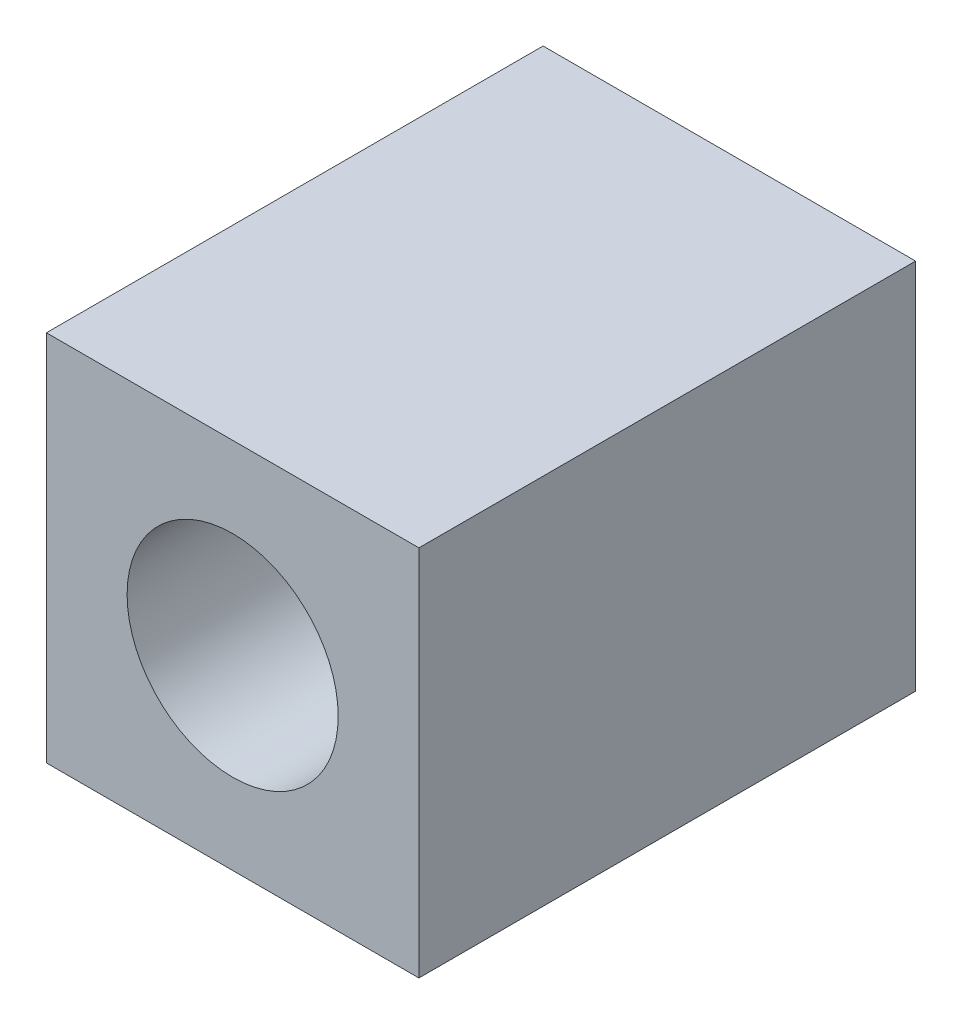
ISO-10303-21;
HEADER;
FILE_DESCRIPTION(('STEP AP214'),'2;1');
FILE_NAME('part.step','',(''),(''),'','','');
FILE_SCHEMA(('AUTOMOTIVE_DESIGN { 1 0 10303 214 1 1 1 1 }'));
ENDSEC;
DATA;
#1=APPLICATION_CONTEXT('core data for automotive mechanical design processes');
#2=APPLICATION_PROTOCOL_DEFINITION('international standard','automotive_design',2000,#1);
#3=PRODUCT_CONTEXT('',#1,'mechanical');
#4=PRODUCT('Part','Part','',(#3));
#5=PRODUCT_RELATED_PRODUCT_CATEGORY('part','',(#4));
#6=PRODUCT_DEFINITION_FORMATION('','',#4);
#7=PRODUCT_DEFINITION_CONTEXT('part definition',#1,'design');
#8=PRODUCT_DEFINITION('design','',#6,#7);
#9=PRODUCT_DEFINITION_SHAPE('','',#8);
#10=(LENGTH_UNIT() NAMED_UNIT(*) SI_UNIT(.MILLI.,.METRE.));
#11=(NAMED_UNIT(*) PLANE_ANGLE_UNIT() SI_UNIT($,.RADIAN.));
#12=(NAMED_UNIT(*) SI_UNIT($,.STERADIAN.) SOLID_ANGLE_UNIT());
#13=UNCERTAINTY_MEASURE_WITH_UNIT(LENGTH_MEASURE(1.E-05),#10,'distance_accuracy_value','');
#14=(GEOMETRIC_REPRESENTATION_CONTEXT(3) GLOBAL_UNCERTAINTY_ASSIGNED_CONTEXT((#13)) GLOBAL_UNIT_ASSIGNED_CONTEXT((#10,
#11,#12)) REPRESENTATION_CONTEXT('',''));
#15=CARTESIAN_POINT('',(0.,0.,0.));
#16=DIRECTION('',(0.,0.,1.));
#17=DIRECTION('',(1.,0.,0.));
#18=AXIS2_PLACEMENT_3D('',#15,#16,#17);
#19=CARTESIAN_POINT('',(-15.,15.,-40.));
#20=DIRECTION('',(-1.,0.,0.));
#21=DIRECTION('',(0.,-1.,0.));
#22=AXIS2_PLACEMENT_3D('',#19,#20,#21);
#23=PLANE('',#22);
#24=DIRECTION('',(0.,-1.,0.));
#25=VECTOR('',#24,1.);
#26=CARTESIAN_POINT('',(-15.,15.,0.));
#27=LINE('',#26,#25);
#28=CARTESIAN_POINT('',(-15.,15.,0.));
#29=VERTEX_POINT('',#28);
#30=CARTESIAN_POINT('',(-15.,-15.,0.));
#31=VERTEX_POINT('',#30);
#32=EDGE_CURVE('E395',#29,#31,#27,.T.);
#33=ORIENTED_EDGE('',*,*,#32,.F.);
#34=DIRECTION('',(0.,0.,1.));
#35=VECTOR('',#34,1.);
#36=CARTESIAN_POINT('',(-15.,15.,-40.));
#37=LINE('',#36,#35);
#38=CARTESIAN_POINT('',(-15.,15.,-40.));
#39=VERTEX_POINT('',#38);
#40=EDGE_CURVE('E11',#39,#29,#37,.T.);
#41=ORIENTED_EDGE('',*,*,#40,.F.);
#42=DIRECTION('',(0.,-1.,0.));
#43=VECTOR('',#42,1.);
#44=CARTESIAN_POINT('',(-15.,15.,-40.));
#45=LINE('',#44,#43);
#46=CARTESIAN_POINT('',(-15.,-15.,-40.));
#47=VERTEX_POINT('',#46);
#48=EDGE_CURVE('E397',#39,#47,#45,.T.);
#49=ORIENTED_EDGE('',*,*,#48,.T.);
#50=DIRECTION('',(0.,0.,1.));
#51=VECTOR('',#50,1.);
#52=CARTESIAN_POINT('',(-15.,-15.,-40.));
#53=LINE('',#52,#51);
#54=EDGE_CURVE('E358',#47,#31,#53,.T.);
#55=ORIENTED_EDGE('',*,*,#54,.T.);
#56=EDGE_LOOP('',(#33,#41,#49,#55));
#57=FACE_BOUND('',#56,.T.);
#58=ADVANCED_FACE('F355',(#57),#23,.T.);
#59=CARTESIAN_POINT('',(-15.,15.,-40.));
#60=DIRECTION('',(0.,1.,0.));
#61=DIRECTION('',(0.,0.,1.));
#62=AXIS2_PLACEMENT_3D('',#59,#60,#61);
#63=PLANE('',#62);
#64=DIRECTION('',(-1.,0.,0.));
#65=VECTOR('',#64,1.);
#66=CARTESIAN_POINT('',(-15.,15.,0.));
#67=LINE('',#66,#65);
#68=CARTESIAN_POINT('',(15.,15.,0.));
#69=VERTEX_POINT('',#68);
#70=EDGE_CURVE('E412',#69,#29,#67,.T.);
#71=ORIENTED_EDGE('',*,*,#70,.F.);
#72=DIRECTION('',(0.,0.,1.));
#73=VECTOR('',#72,1.);
#74=CARTESIAN_POINT('',(15.,15.,-40.));
#75=LINE('',#74,#73);
#76=CARTESIAN_POINT('',(15.,15.,-40.));
#77=VERTEX_POINT('',#76);
#78=EDGE_CURVE('E363',#77,#69,#75,.T.);
#79=ORIENTED_EDGE('',*,*,#78,.F.);
#80=DIRECTION('',(-1.,0.,0.));
#81=VECTOR('',#80,1.);
#82=CARTESIAN_POINT('',(-15.,15.,-40.));
#83=LINE('',#82,#81);
#84=EDGE_CURVE('E402',#77,#39,#83,.T.);
#85=ORIENTED_EDGE('',*,*,#84,.T.);
#86=ORIENTED_EDGE('',*,*,#40,.T.);
#87=EDGE_LOOP('',(#71,#79,#85,#86));
#88=FACE_BOUND('',#87,.T.);
#89=ADVANCED_FACE('F432',(#88),#63,.T.);
#90=CARTESIAN_POINT('',(15.,15.,-40.));
#91=DIRECTION('',(1.,0.,0.));
#92=DIRECTION('',(0.,1.,0.));
#93=AXIS2_PLACEMENT_3D('',#90,#91,#92);
#94=PLANE('',#93);
#95=DIRECTION('',(0.,1.,0.));
#96=VECTOR('',#95,1.);
#97=CARTESIAN_POINT('',(15.,15.,0.));
#98=LINE('',#97,#96);
#99=CARTESIAN_POINT('',(15.,-15.,0.));
#100=VERTEX_POINT('',#99);
#101=EDGE_CURVE('E409',#100,#69,#98,.T.);
#102=ORIENTED_EDGE('',*,*,#101,.F.);
#103=DIRECTION('',(0.,0.,1.));
#104=VECTOR('',#103,1.);
#105=CARTESIAN_POINT('',(15.,-15.,-40.));
#106=LINE('',#105,#104);
#107=CARTESIAN_POINT('',(15.,-15.,-40.));
#108=VERTEX_POINT('',#107);
#109=EDGE_CURVE('E401',#108,#100,#106,.T.);
#110=ORIENTED_EDGE('',*,*,#109,.F.);
#111=DIRECTION('',(0.,1.,0.));
#112=VECTOR('',#111,1.);
#113=CARTESIAN_POINT('',(15.,15.,-40.));
#114=LINE('',#113,#112);
#115=EDGE_CURVE('E425',#108,#77,#114,.T.);
#116=ORIENTED_EDGE('',*,*,#115,.T.);
#117=ORIENTED_EDGE('',*,*,#78,.T.);
#118=EDGE_LOOP('',(#102,#110,#116,#117));
#119=FACE_BOUND('',#118,.T.);
#120=ADVANCED_FACE('F429',(#119),#94,.T.);
#121=CARTESIAN_POINT('',(-15.,-15.,-40.));
#122=DIRECTION('',(0.,-1.,0.));
#123=DIRECTION('',(0.,0.,-1.));
#124=AXIS2_PLACEMENT_3D('',#121,#122,#123);
#125=PLANE('',#124);
#126=DIRECTION('',(1.,0.,0.));
#127=VECTOR('',#126,1.);
#128=CARTESIAN_POINT('',(-15.,-15.,0.));
#129=LINE('',#128,#127);
#130=EDGE_CURVE('E404',#31,#100,#129,.T.);
#131=ORIENTED_EDGE('',*,*,#130,.F.);
#132=ORIENTED_EDGE('',*,*,#54,.F.);
#133=DIRECTION('',(1.,0.,0.));
#134=VECTOR('',#133,1.);
#135=CARTESIAN_POINT('',(-15.,-15.,-40.));
#136=LINE('',#135,#134);
#137=EDGE_CURVE('E423',#47,#108,#136,.T.);
#138=ORIENTED_EDGE('',*,*,#137,.T.);
#139=ORIENTED_EDGE('',*,*,#109,.T.);
#140=EDGE_LOOP('',(#131,#132,#138,#139));
#141=FACE_BOUND('',#140,.T.);
#142=ADVANCED_FACE('F405',(#141),#125,.T.);
#143=CARTESIAN_POINT('',(-15.,-15.,-40.));
#144=DIRECTION('',(0.,0.,1.));
#145=DIRECTION('',(1.,0.,0.));
#146=AXIS2_PLACEMENT_3D('',#143,#144,#145);
#147=PLANE('',#146);
#148=CARTESIAN_POINT('',(0.,0.,-40.));
#149=DIRECTION('',(0.,0.,1.));
#150=DIRECTION('',(1.,0.,0.));
#151=AXIS2_PLACEMENT_3D('',#148,#149,#150);
#152=CIRCLE('',#151,8.5);
#153=CARTESIAN_POINT('',(8.5,0.,-40.));
#154=VERTEX_POINT('',#153);
#155=EDGE_CURVE('E413',#154,#154,#152,.T.);
#156=ORIENTED_EDGE('',*,*,#155,.T.);
#157=EDGE_LOOP('',(#156));
#158=FACE_BOUND('',#157,.T.);
#159=ORIENTED_EDGE('',*,*,#48,.F.);
#160=ORIENTED_EDGE('',*,*,#84,.F.);
#161=ORIENTED_EDGE('',*,*,#115,.F.);
#162=ORIENTED_EDGE('',*,*,#137,.F.);
#163=EDGE_LOOP('',(#159,#160,#161,#162));
#164=FACE_BOUND('',#163,.T.);
#165=ADVANCED_FACE('F434',(#158,#164),#147,.F.);
#166=CARTESIAN_POINT('',(-15.,-15.,0.));
#167=DIRECTION('',(0.,0.,1.));
#168=DIRECTION('',(1.,0.,0.));
#169=AXIS2_PLACEMENT_3D('',#166,#167,#168);
#170=PLANE('',#169);
#171=CARTESIAN_POINT('',(0.,0.,0.));
#172=DIRECTION('',(0.,0.,1.));
#173=DIRECTION('',(1.,0.,0.));
#174=AXIS2_PLACEMENT_3D('',#171,#172,#173);
#175=CIRCLE('',#174,8.5);
#176=CARTESIAN_POINT('',(8.5,0.,0.));
#177=VERTEX_POINT('',#176);
#178=EDGE_CURVE('E416',#177,#177,#175,.T.);
#179=ORIENTED_EDGE('',*,*,#178,.F.);
#180=EDGE_LOOP('',(#179));
#181=FACE_BOUND('',#180,.T.);
#182=ORIENTED_EDGE('',*,*,#32,.T.);
#183=ORIENTED_EDGE('',*,*,#130,.T.);
#184=ORIENTED_EDGE('',*,*,#101,.T.);
#185=ORIENTED_EDGE('',*,*,#70,.T.);
#186=EDGE_LOOP('',(#182,#183,#184,#185));
#187=FACE_BOUND('',#186,.T.);
#188=ADVANCED_FACE('F411',(#181,#187),#170,.T.);
#189=CARTESIAN_POINT('',(0.,0.,-40.));
#190=DIRECTION('',(0.,0.,1.));
#191=DIRECTION('',(1.,0.,0.));
#192=AXIS2_PLACEMENT_3D('',#189,#190,#191);
#193=CYLINDRICAL_SURFACE('',#192,8.5);
#194=ORIENTED_EDGE('',*,*,#155,.F.);
#195=EDGE_LOOP('',(#194));
#196=FACE_BOUND('',#195,.T.);
#197=ORIENTED_EDGE('',*,*,#178,.T.);
#198=EDGE_LOOP('',(#197));
#199=FACE_BOUND('',#198,.T.);
#200=ADVANCED_FACE('F442',(#196,#199),#193,.F.);
#201=CLOSED_SHELL('',(#58,#89,#120,#142,#165,#188,#200));
#202=MANIFOLD_SOLID_BREP('B2',#201);
#203=ADVANCED_BREP_SHAPE_REPRESENTATION('',(#18,#202),#14);
#204=SHAPE_DEFINITION_REPRESENTATION(#9,#203);
ENDSEC;
END-ISO-10303-21;
